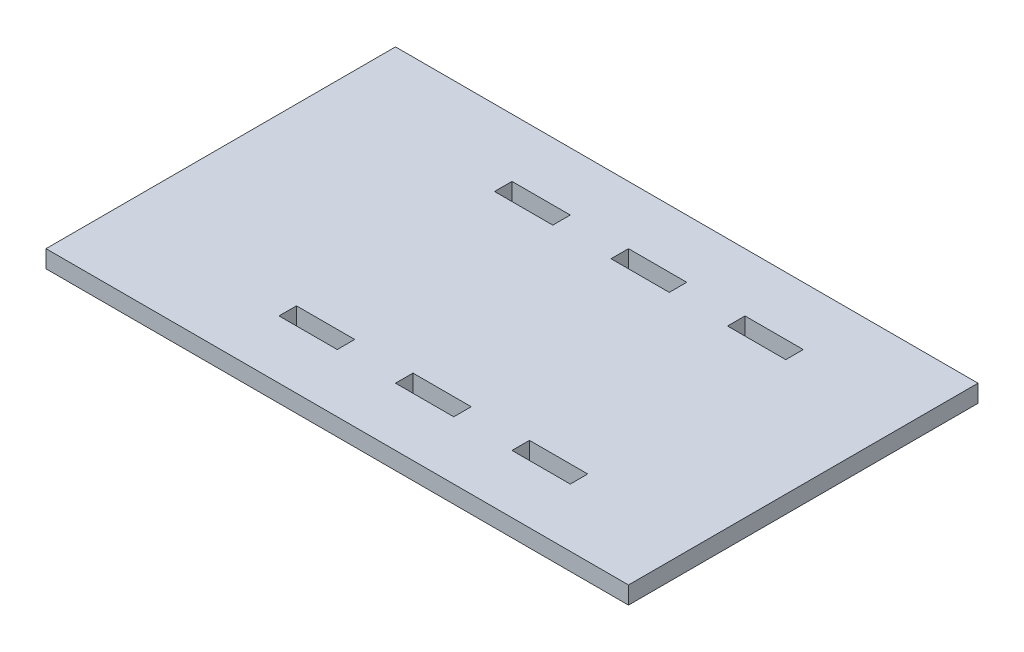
from build123d import *

# Parameters (mm, degrees)
SKETCH1_W           = 500
SKETCH1_H           = 300
BOSS_EXTRUDE1_DEPTH = 15
SKETCH2_W           = 50
SKETCH2_H           = 15
CUT_EXTRUDE1_DEPTH  = 15


with BuildPart() as part:
    # Sketch1 → Boss-Extrude1 (new body)
    with BuildSketch(Plane(origin=(0, 0, 0), x_dir=(1, 0, 0), z_dir=(0, 1, 0))):
        Rectangle(SKETCH1_W, SKETCH1_H)
    extrude(amount=BOSS_EXTRUDE1_DEPTH)

    # Sketch2 → Cut-Extrude1 (cut)
    with BuildSketch(Plane(origin=(0, 15, 0), x_dir=(1, 0, 0), z_dir=(0, 1, 0))):
        with Locations((-75, -92.5)):
            Rectangle(SKETCH2_W, SKETCH2_H)
        with Locations((25, -92.5)):
            Rectangle(SKETCH2_W, SKETCH2_H)
        with Locations((125, -92.5)):
            Rectangle(SKETCH2_W, SKETCH2_H)
        with Locations((125, 92.5)):
            Rectangle(SKETCH2_W, SKETCH2_H)
        with Locations((25, 92.5)):
            Rectangle(SKETCH2_W, SKETCH2_H)
        with Locations((-75, 92.5)):
            Rectangle(SKETCH2_W, SKETCH2_H)
    extrude(amount=-CUT_EXTRUDE1_DEPTH, mode=Mode.SUBTRACT)


solid = part.part
